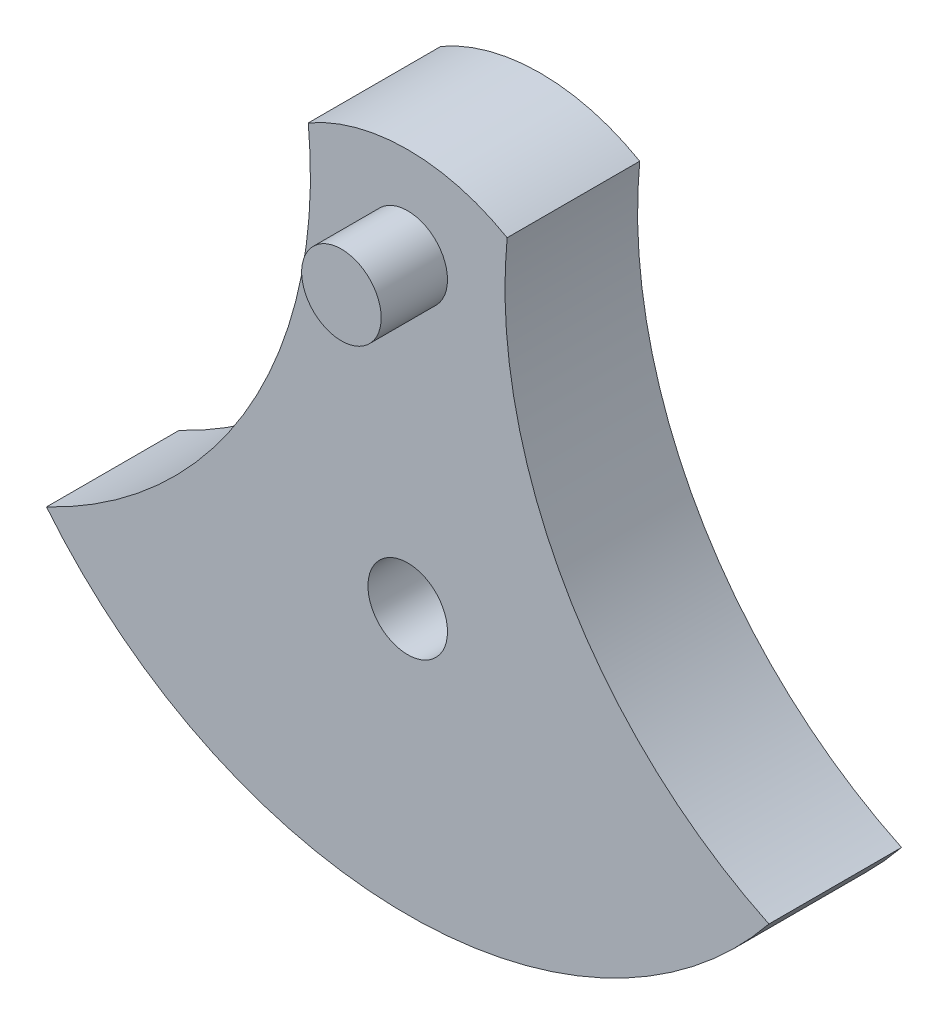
ISO-10303-21;
HEADER;
FILE_DESCRIPTION(('STEP AP214'),'2;1');
FILE_NAME('part.step','',(''),(''),'','','');
FILE_SCHEMA(('AUTOMOTIVE_DESIGN { 1 0 10303 214 1 1 1 1 }'));
ENDSEC;
DATA;
#1=APPLICATION_CONTEXT('core data for automotive mechanical design processes');
#2=APPLICATION_PROTOCOL_DEFINITION('international standard','automotive_design',2000,#1);
#3=PRODUCT_CONTEXT('',#1,'mechanical');
#4=PRODUCT('Part','Part','',(#3));
#5=PRODUCT_RELATED_PRODUCT_CATEGORY('part','',(#4));
#6=PRODUCT_DEFINITION_FORMATION('','',#4);
#7=PRODUCT_DEFINITION_CONTEXT('part definition',#1,'design');
#8=PRODUCT_DEFINITION('design','',#6,#7);
#9=PRODUCT_DEFINITION_SHAPE('','',#8);
#10=(LENGTH_UNIT() NAMED_UNIT(*) SI_UNIT(.MILLI.,.METRE.));
#11=(NAMED_UNIT(*) PLANE_ANGLE_UNIT() SI_UNIT($,.RADIAN.));
#12=(NAMED_UNIT(*) SI_UNIT($,.STERADIAN.) SOLID_ANGLE_UNIT());
#13=UNCERTAINTY_MEASURE_WITH_UNIT(LENGTH_MEASURE(1.E-05),#10,'distance_accuracy_value','');
#14=(GEOMETRIC_REPRESENTATION_CONTEXT(3) GLOBAL_UNCERTAINTY_ASSIGNED_CONTEXT((#13)) GLOBAL_UNIT_ASSIGNED_CONTEXT((#10,
#11,#12)) REPRESENTATION_CONTEXT('',''));
#15=CARTESIAN_POINT('',(0.,0.,0.));
#16=DIRECTION('',(0.,0.,1.));
#17=DIRECTION('',(1.,0.,0.));
#18=AXIS2_PLACEMENT_3D('',#15,#16,#17);
#19=CARTESIAN_POINT('',(0.,15.,-10.));
#20=DIRECTION('',(0.,0.,1.));
#21=DIRECTION('',(1.,0.,0.));
#22=AXIS2_PLACEMENT_3D('',#19,#20,#21);
#23=CYLINDRICAL_SURFACE('',#22,15.);
#24=CARTESIAN_POINT('',(0.,15.,0.));
#25=DIRECTION('',(0.,0.,1.));
#26=DIRECTION('',(1.,0.,0.));
#27=AXIS2_PLACEMENT_3D('',#24,#25,#26);
#28=CIRCLE('',#27,15.);
#29=CARTESIAN_POINT('',(7.50000000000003,27.9903810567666,0.));
#30=VERTEX_POINT('',#29);
#31=CARTESIAN_POINT('',(-7.50000000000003,27.9903810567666,0.));
#32=VERTEX_POINT('',#31);
#33=EDGE_CURVE('E97',#30,#32,#28,.T.);
#34=ORIENTED_EDGE('',*,*,#33,.F.);
#35=DIRECTION('',(0.,0.,1.));
#36=VECTOR('',#35,1.);
#37=CARTESIAN_POINT('',(7.50000000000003,27.9903810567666,-10.));
#38=LINE('',#37,#36);
#39=CARTESIAN_POINT('',(7.50000000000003,27.9903810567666,-10.));
#40=VERTEX_POINT('',#39);
#41=EDGE_CURVE('E11',#40,#30,#38,.T.);
#42=ORIENTED_EDGE('',*,*,#41,.F.);
#43=CARTESIAN_POINT('',(0.,15.,-10.));
#44=DIRECTION('',(0.,0.,1.));
#45=DIRECTION('',(1.,0.,0.));
#46=AXIS2_PLACEMENT_3D('',#43,#44,#45);
#47=CIRCLE('',#46,15.);
#48=CARTESIAN_POINT('',(-7.50000000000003,27.9903810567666,-10.));
#49=VERTEX_POINT('',#48);
#50=EDGE_CURVE('E90',#40,#49,#47,.T.);
#51=ORIENTED_EDGE('',*,*,#50,.T.);
#52=DIRECTION('',(0.,0.,1.));
#53=VECTOR('',#52,1.);
#54=CARTESIAN_POINT('',(-7.50000000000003,27.9903810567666,-10.));
#55=LINE('',#54,#53);
#56=EDGE_CURVE('E35',#49,#32,#55,.T.);
#57=ORIENTED_EDGE('',*,*,#56,.T.);
#58=EDGE_LOOP('',(#34,#42,#51,#57));
#59=FACE_BOUND('',#58,.T.);
#60=ADVANCED_FACE('F32',(#59),#23,.T.);
#61=CARTESIAN_POINT('',(42.3365459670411,24.61176224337,-10.));
#62=DIRECTION('',(0.,0.,1.));
#63=DIRECTION('',(1.,0.,0.));
#64=AXIS2_PLACEMENT_3D('',#61,#62,#63);
#65=CYLINDRICAL_SURFACE('',#64,35.);
#66=CARTESIAN_POINT('',(42.3365459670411,24.61176224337,0.));
#67=DIRECTION('',(0.,0.,-1.));
#68=DIRECTION('',(1.,0.,0.));
#69=AXIS2_PLACEMENT_3D('',#66,#67,#68);
#70=CIRCLE('',#69,35.);
#71=CARTESIAN_POINT('',(27.2468823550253,-6.96832724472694,0.));
#72=VERTEX_POINT('',#71);
#73=EDGE_CURVE('E92',#72,#30,#70,.T.);
#74=ORIENTED_EDGE('',*,*,#73,.F.);
#75=DIRECTION('',(0.,0.,1.));
#76=VECTOR('',#75,1.);
#77=CARTESIAN_POINT('',(27.2468823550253,-6.96832724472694,-10.));
#78=LINE('',#77,#76);
#79=CARTESIAN_POINT('',(27.2468823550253,-6.96832724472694,-10.));
#80=VERTEX_POINT('',#79);
#81=EDGE_CURVE('E41',#80,#72,#78,.T.);
#82=ORIENTED_EDGE('',*,*,#81,.F.);
#83=CARTESIAN_POINT('',(42.3365459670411,24.61176224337,-10.));
#84=DIRECTION('',(0.,0.,-1.));
#85=DIRECTION('',(1.,0.,0.));
#86=AXIS2_PLACEMENT_3D('',#83,#84,#85);
#87=CIRCLE('',#86,35.);
#88=EDGE_CURVE('E87',#80,#40,#87,.T.);
#89=ORIENTED_EDGE('',*,*,#88,.T.);
#90=ORIENTED_EDGE('',*,*,#41,.T.);
#91=EDGE_LOOP('',(#74,#82,#89,#90));
#92=FACE_BOUND('',#91,.T.);
#93=ADVANCED_FACE('F108',(#92),#65,.F.);
#94=CARTESIAN_POINT('',(0.,15.,-10.));
#95=DIRECTION('',(0.,0.,1.));
#96=DIRECTION('',(1.,0.,0.));
#97=AXIS2_PLACEMENT_3D('',#94,#95,#96);
#98=CYLINDRICAL_SURFACE('',#97,35.);
#99=CARTESIAN_POINT('',(0.,15.,0.));
#100=DIRECTION('',(0.,0.,1.));
#101=DIRECTION('',(1.,0.,0.));
#102=AXIS2_PLACEMENT_3D('',#99,#100,#101);
#103=CIRCLE('',#102,35.);
#104=CARTESIAN_POINT('',(-27.2468823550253,-6.96832724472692,0.));
#105=VERTEX_POINT('',#104);
#106=EDGE_CURVE('E82',#105,#72,#103,.T.);
#107=ORIENTED_EDGE('',*,*,#106,.F.);
#108=DIRECTION('',(0.,0.,1.));
#109=VECTOR('',#108,1.);
#110=CARTESIAN_POINT('',(-27.2468823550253,-6.96832724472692,-10.));
#111=LINE('',#110,#109);
#112=CARTESIAN_POINT('',(-27.2468823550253,-6.96832724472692,-10.));
#113=VERTEX_POINT('',#112);
#114=EDGE_CURVE('E77',#113,#105,#111,.T.);
#115=ORIENTED_EDGE('',*,*,#114,.F.);
#116=CARTESIAN_POINT('',(0.,15.,-10.));
#117=DIRECTION('',(0.,0.,1.));
#118=DIRECTION('',(1.,0.,0.));
#119=AXIS2_PLACEMENT_3D('',#116,#117,#118);
#120=CIRCLE('',#119,35.);
#121=EDGE_CURVE('E80',#113,#80,#120,.T.);
#122=ORIENTED_EDGE('',*,*,#121,.T.);
#123=ORIENTED_EDGE('',*,*,#81,.T.);
#124=EDGE_LOOP('',(#107,#115,#122,#123));
#125=FACE_BOUND('',#124,.T.);
#126=ADVANCED_FACE('F79',(#125),#98,.T.);
#127=CARTESIAN_POINT('',(-42.3365459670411,24.61176224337,-10.));
#128=DIRECTION('',(0.,0.,1.));
#129=DIRECTION('',(1.,0.,0.));
#130=AXIS2_PLACEMENT_3D('',#127,#128,#129);
#131=CYLINDRICAL_SURFACE('',#130,35.);
#132=CARTESIAN_POINT('',(-42.3365459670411,24.61176224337,0.));
#133=DIRECTION('',(0.,0.,-1.));
#134=DIRECTION('',(-1.,0.,0.));
#135=AXIS2_PLACEMENT_3D('',#132,#133,#134);
#136=CIRCLE('',#135,35.);
#137=EDGE_CURVE('E100',#32,#105,#136,.T.);
#138=ORIENTED_EDGE('',*,*,#137,.F.);
#139=ORIENTED_EDGE('',*,*,#56,.F.);
#140=CARTESIAN_POINT('',(-42.3365459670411,24.61176224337,-10.));
#141=DIRECTION('',(0.,0.,-1.));
#142=DIRECTION('',(-1.,0.,0.));
#143=AXIS2_PLACEMENT_3D('',#140,#141,#142);
#144=CIRCLE('',#143,35.);
#145=EDGE_CURVE('E86',#49,#113,#144,.T.);
#146=ORIENTED_EDGE('',*,*,#145,.T.);
#147=ORIENTED_EDGE('',*,*,#114,.T.);
#148=EDGE_LOOP('',(#138,#139,#146,#147));
#149=FACE_BOUND('',#148,.T.);
#150=ADVANCED_FACE('F89',(#149),#131,.F.);
#151=CARTESIAN_POINT('',(-21.1682729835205,19.805881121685,-10.));
#152=DIRECTION('',(0.,0.,1.));
#153=DIRECTION('',(1.,0.,0.));
#154=AXIS2_PLACEMENT_3D('',#151,#152,#153);
#155=PLANE('',#154);
#156=CARTESIAN_POINT('',(0.,0.,-10.));
#157=DIRECTION('',(0.,0.,1.));
#158=DIRECTION('',(1.,0.,0.));
#159=AXIS2_PLACEMENT_3D('',#156,#157,#158);
#160=CIRCLE('',#159,3.);
#161=CARTESIAN_POINT('',(3.,0.,-10.));
#162=VERTEX_POINT('',#161);
#163=EDGE_CURVE('E149',#162,#162,#160,.T.);
#164=ORIENTED_EDGE('',*,*,#163,.T.);
#165=EDGE_LOOP('',(#164));
#166=FACE_BOUND('',#165,.T.);
#167=ORIENTED_EDGE('',*,*,#50,.F.);
#168=ORIENTED_EDGE('',*,*,#88,.F.);
#169=ORIENTED_EDGE('',*,*,#121,.F.);
#170=ORIENTED_EDGE('',*,*,#145,.F.);
#171=EDGE_LOOP('',(#167,#168,#169,#170));
#172=FACE_BOUND('',#171,.T.);
#173=ADVANCED_FACE('F85',(#166,#172),#155,.F.);
#174=CARTESIAN_POINT('',(-21.1682729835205,19.805881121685,0.));
#175=DIRECTION('',(0.,0.,1.));
#176=DIRECTION('',(1.,0.,0.));
#177=AXIS2_PLACEMENT_3D('',#174,#175,#176);
#178=PLANE('',#177);
#179=CARTESIAN_POINT('',(0.,0.,0.));
#180=DIRECTION('',(0.,0.,1.));
#181=DIRECTION('',(1.,0.,0.));
#182=AXIS2_PLACEMENT_3D('',#179,#180,#181);
#183=CIRCLE('',#182,3.);
#184=CARTESIAN_POINT('',(3.,0.,0.));
#185=VERTEX_POINT('',#184);
#186=EDGE_CURVE('E146',#185,#185,#183,.T.);
#187=ORIENTED_EDGE('',*,*,#186,.F.);
#188=EDGE_LOOP('',(#187));
#189=FACE_BOUND('',#188,.T.);
#190=CARTESIAN_POINT('',(0.,23.,0.));
#191=DIRECTION('',(0.,0.,1.));
#192=DIRECTION('',(1.,0.,0.));
#193=AXIS2_PLACEMENT_3D('',#190,#191,#192);
#194=CIRCLE('',#193,3.);
#195=CARTESIAN_POINT('',(3.,23.,0.));
#196=VERTEX_POINT('',#195);
#197=EDGE_CURVE('E101',#196,#196,#194,.T.);
#198=ORIENTED_EDGE('',*,*,#197,.F.);
#199=EDGE_LOOP('',(#198));
#200=FACE_BOUND('',#199,.T.);
#201=ORIENTED_EDGE('',*,*,#33,.T.);
#202=ORIENTED_EDGE('',*,*,#137,.T.);
#203=ORIENTED_EDGE('',*,*,#106,.T.);
#204=ORIENTED_EDGE('',*,*,#73,.T.);
#205=EDGE_LOOP('',(#201,#202,#203,#204));
#206=FACE_BOUND('',#205,.T.);
#207=ADVANCED_FACE('F107',(#189,#200,#206),#178,.T.);
#208=CARTESIAN_POINT('',(0.,0.,-10.));
#209=DIRECTION('',(0.,0.,1.));
#210=DIRECTION('',(1.,0.,0.));
#211=AXIS2_PLACEMENT_3D('',#208,#209,#210);
#212=CYLINDRICAL_SURFACE('',#211,3.);
#213=ORIENTED_EDGE('',*,*,#163,.F.);
#214=EDGE_LOOP('',(#213));
#215=FACE_BOUND('',#214,.T.);
#216=ORIENTED_EDGE('',*,*,#186,.T.);
#217=EDGE_LOOP('',(#216));
#218=FACE_BOUND('',#217,.T.);
#219=ADVANCED_FACE('F126',(#215,#218),#212,.F.);
#220=CARTESIAN_POINT('',(0.,23.000000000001,-10.));
#221=DIRECTION('',(0.,0.,1.));
#222=DIRECTION('',(1.,0.,0.));
#223=AXIS2_PLACEMENT_3D('',#220,#221,#222);
#224=CYLINDRICAL_SURFACE('',#223,3.);
#225=ORIENTED_EDGE('',*,*,#197,.T.);
#226=EDGE_LOOP('',(#225));
#227=FACE_BOUND('',#226,.T.);
#228=CARTESIAN_POINT('',(0.,23.000000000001,5.));
#229=DIRECTION('',(0.,0.,1.));
#230=DIRECTION('',(1.00000000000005,0.,0.));
#231=AXIS2_PLACEMENT_3D('',#228,#229,#230);
#232=CIRCLE('',#231,3.);
#233=CARTESIAN_POINT('',(3.00000000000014,23.000000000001,5.));
#234=VERTEX_POINT('',#233);
#235=EDGE_CURVE('E144',#234,#234,#232,.T.);
#236=ORIENTED_EDGE('',*,*,#235,.F.);
#237=EDGE_LOOP('',(#236));
#238=FACE_BOUND('',#237,.T.);
#239=ADVANCED_FACE('F132',(#227,#238),#224,.T.);
#240=CARTESIAN_POINT('',(0.,0.,5.));
#241=DIRECTION('',(0.,0.,1.));
#242=DIRECTION('',(1.00000000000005,0.,0.));
#243=AXIS2_PLACEMENT_3D('',#240,#241,#242);
#244=PLANE('',#243);
#245=ORIENTED_EDGE('',*,*,#235,.T.);
#246=EDGE_LOOP('',(#245));
#247=FACE_BOUND('',#246,.T.);
#248=ADVANCED_FACE('F136',(#247),#244,.T.);
#249=CLOSED_SHELL('',(#60,#93,#126,#150,#173,#207,#219,#239,#248));
#250=MANIFOLD_SOLID_BREP('B2',#249);
#251=ADVANCED_BREP_SHAPE_REPRESENTATION('',(#18,#250),#14);
#252=SHAPE_DEFINITION_REPRESENTATION(#9,#251);
ENDSEC;
END-ISO-10303-21;
